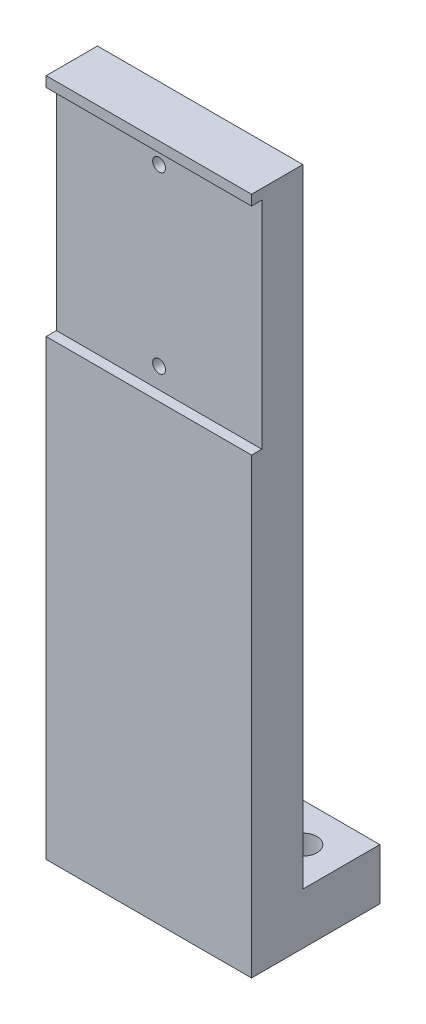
ISO-10303-21;
HEADER;
FILE_DESCRIPTION(('STEP AP214'),'2;1');
FILE_NAME('part.step','',(''),(''),'','','');
FILE_SCHEMA(('AUTOMOTIVE_DESIGN { 1 0 10303 214 1 1 1 1 }'));
ENDSEC;
DATA;
#1=APPLICATION_CONTEXT('core data for automotive mechanical design processes');
#2=APPLICATION_PROTOCOL_DEFINITION('international standard','automotive_design',2000,#1);
#3=PRODUCT_CONTEXT('',#1,'mechanical');
#4=PRODUCT('Part','Part','',(#3));
#5=PRODUCT_RELATED_PRODUCT_CATEGORY('part','',(#4));
#6=PRODUCT_DEFINITION_FORMATION('','',#4);
#7=PRODUCT_DEFINITION_CONTEXT('part definition',#1,'design');
#8=PRODUCT_DEFINITION('design','',#6,#7);
#9=PRODUCT_DEFINITION_SHAPE('','',#8);
#10=(LENGTH_UNIT() NAMED_UNIT(*) SI_UNIT(.MILLI.,.METRE.));
#11=(NAMED_UNIT(*) PLANE_ANGLE_UNIT() SI_UNIT($,.RADIAN.));
#12=(NAMED_UNIT(*) SI_UNIT($,.STERADIAN.) SOLID_ANGLE_UNIT());
#13=UNCERTAINTY_MEASURE_WITH_UNIT(LENGTH_MEASURE(1.E-05),#10,'distance_accuracy_value','');
#14=(GEOMETRIC_REPRESENTATION_CONTEXT(3) GLOBAL_UNCERTAINTY_ASSIGNED_CONTEXT((#13)) GLOBAL_UNIT_ASSIGNED_CONTEXT((#10,
#11,#12)) REPRESENTATION_CONTEXT('',''));
#15=CARTESIAN_POINT('',(0.,0.,0.));
#16=DIRECTION('',(0.,0.,1.));
#17=DIRECTION('',(1.,0.,0.));
#18=AXIS2_PLACEMENT_3D('',#15,#16,#17);
#19=CARTESIAN_POINT('',(40.,0.,25.));
#20=DIRECTION('',(0.,0.,1.));
#21=DIRECTION('',(1.,0.,0.));
#22=AXIS2_PLACEMENT_3D('',#19,#20,#21);
#23=PLANE('',#22);
#24=DIRECTION('',(0.,1.,0.));
#25=VECTOR('',#24,1.);
#26=CARTESIAN_POINT('',(40.,0.,25.));
#27=LINE('',#26,#25);
#28=CARTESIAN_POINT('',(40.,0.00372010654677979,24.9999999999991));
#29=VERTEX_POINT('',#28);
#30=CARTESIAN_POINT('',(40.,88.2037201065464,24.9999999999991));
#31=VERTEX_POINT('',#30);
#32=EDGE_CURVE('E131',#29,#31,#27,.T.);
#33=ORIENTED_EDGE('',*,*,#32,.T.);
#34=DIRECTION('',(1.,0.,0.));
#35=VECTOR('',#34,1.);
#36=CARTESIAN_POINT('',(0.,88.2037201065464,24.9999999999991));
#37=LINE('',#36,#35);
#38=CARTESIAN_POINT('',(0.,88.2037201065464,24.9999999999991));
#39=VERTEX_POINT('',#38);
#40=EDGE_CURVE('E116',#39,#31,#37,.T.);
#41=ORIENTED_EDGE('',*,*,#40,.F.);
#42=DIRECTION('',(0.,-1.,0.));
#43=VECTOR('',#42,1.);
#44=CARTESIAN_POINT('',(0.,0.,25.));
#45=LINE('',#44,#43);
#46=CARTESIAN_POINT('',(0.,0.00372010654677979,25.));
#47=VERTEX_POINT('',#46);
#48=EDGE_CURVE('E129',#39,#47,#45,.T.);
#49=ORIENTED_EDGE('',*,*,#48,.T.);
#50=DIRECTION('',(1.,0.,0.));
#51=VECTOR('',#50,1.);
#52=CARTESIAN_POINT('',(0.,0.00372010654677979,24.9999999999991));
#53=LINE('',#52,#51);
#54=EDGE_CURVE('E50',#47,#29,#53,.T.);
#55=ORIENTED_EDGE('',*,*,#54,.T.);
#56=EDGE_LOOP('',(#33,#41,#49,#55));
#57=FACE_BOUND('',#56,.T.);
#58=ADVANCED_FACE('F33',(#57),#23,.T.);
#59=CARTESIAN_POINT('',(0.,132.2,25.));
#60=VERTEX_POINT('',#59);
#61=CARTESIAN_POINT('',(0.,130.203720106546,25.));
#62=VERTEX_POINT('',#61);
#63=EDGE_CURVE('E136',#60,#62,#45,.T.);
#64=ORIENTED_EDGE('',*,*,#63,.T.);
#65=DIRECTION('',(1.,0.,0.));
#66=VECTOR('',#65,1.);
#67=CARTESIAN_POINT('',(0.,130.203720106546,24.9999999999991));
#68=LINE('',#67,#66);
#69=CARTESIAN_POINT('',(40.,130.203720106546,24.9999999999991));
#70=VERTEX_POINT('',#69);
#71=EDGE_CURVE('E58',#62,#70,#68,.T.);
#72=ORIENTED_EDGE('',*,*,#71,.T.);
#73=CARTESIAN_POINT('',(40.,132.2,25.));
#74=VERTEX_POINT('',#73);
#75=EDGE_CURVE('E149',#70,#74,#27,.T.);
#76=ORIENTED_EDGE('',*,*,#75,.T.);
#77=DIRECTION('',(-1.,0.,0.));
#78=VECTOR('',#77,1.);
#79=CARTESIAN_POINT('',(0.,132.2,25.));
#80=LINE('',#79,#78);
#81=EDGE_CURVE('E137',#74,#60,#80,.T.);
#82=ORIENTED_EDGE('',*,*,#81,.T.);
#83=EDGE_LOOP('',(#64,#72,#76,#82));
#84=FACE_BOUND('',#83,.T.);
#85=ADVANCED_FACE('F216',(#84),#23,.T.);
#86=CARTESIAN_POINT('',(40.,0.,0.));
#87=DIRECTION('',(0.,0.,1.));
#88=DIRECTION('',(1.,0.,0.));
#89=AXIS2_PLACEMENT_3D('',#86,#87,#88);
#90=PLANE('',#89);
#91=DIRECTION('',(1.,0.,0.));
#92=VECTOR('',#91,1.);
#93=CARTESIAN_POINT('',(0.,10.0037201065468,-9.09494701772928E-13));
#94=LINE('',#93,#92);
#95=CARTESIAN_POINT('',(0.,10.0037201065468,0.));
#96=VERTEX_POINT('',#95);
#97=CARTESIAN_POINT('',(40.,10.0037201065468,-9.09494701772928E-13));
#98=VERTEX_POINT('',#97);
#99=EDGE_CURVE('E203',#96,#98,#94,.T.);
#100=ORIENTED_EDGE('',*,*,#99,.T.);
#101=DIRECTION('',(0.,1.,0.));
#102=VECTOR('',#101,1.);
#103=CARTESIAN_POINT('',(40.,0.,0.));
#104=LINE('',#103,#102);
#105=CARTESIAN_POINT('',(40.,0.00372010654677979,-9.09494701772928E-13));
#106=VERTEX_POINT('',#105);
#107=EDGE_CURVE('E143',#106,#98,#104,.T.);
#108=ORIENTED_EDGE('',*,*,#107,.F.);
#109=DIRECTION('',(1.,0.,0.));
#110=VECTOR('',#109,1.);
#111=CARTESIAN_POINT('',(0.,0.00372010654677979,-9.09494701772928E-13));
#112=LINE('',#111,#110);
#113=CARTESIAN_POINT('',(0.,0.00372010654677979,-9.09494701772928E-13));
#114=VERTEX_POINT('',#113);
#115=EDGE_CURVE('E206',#114,#106,#112,.T.);
#116=ORIENTED_EDGE('',*,*,#115,.F.);
#117=DIRECTION('',(0.,-1.,0.));
#118=VECTOR('',#117,1.);
#119=CARTESIAN_POINT('',(0.,0.,0.));
#120=LINE('',#119,#118);
#121=EDGE_CURVE('E146',#96,#114,#120,.T.);
#122=ORIENTED_EDGE('',*,*,#121,.F.);
#123=EDGE_LOOP('',(#100,#108,#116,#122));
#124=FACE_BOUND('',#123,.T.);
#125=ADVANCED_FACE('F233',(#124),#90,.F.);
#126=CARTESIAN_POINT('',(40.,0.,25.));
#127=DIRECTION('',(-1.,0.,0.));
#128=DIRECTION('',(0.,0.,1.));
#129=AXIS2_PLACEMENT_3D('',#126,#127,#128);
#130=PLANE('',#129);
#131=DIRECTION('',(0.,0.,1.));
#132=VECTOR('',#131,1.);
#133=CARTESIAN_POINT('',(40.,88.2037201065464,24.9999999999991));
#134=LINE('',#133,#132);
#135=CARTESIAN_POINT('',(40.,88.2037201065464,22.9999999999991));
#136=VERTEX_POINT('',#135);
#137=EDGE_CURVE('E161',#136,#31,#134,.T.);
#138=ORIENTED_EDGE('',*,*,#137,.T.);
#139=ORIENTED_EDGE('',*,*,#32,.F.);
#140=DIRECTION('',(0.,0.,-1.));
#141=VECTOR('',#140,1.);
#142=CARTESIAN_POINT('',(40.,0.00372010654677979,24.9999999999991));
#143=LINE('',#142,#141);
#144=EDGE_CURVE('E165',#29,#106,#143,.T.);
#145=ORIENTED_EDGE('',*,*,#144,.T.);
#146=ORIENTED_EDGE('',*,*,#107,.T.);
#147=DIRECTION('',(0.,0.,1.));
#148=VECTOR('',#147,1.);
#149=CARTESIAN_POINT('',(40.,10.0037201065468,14.9999999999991));
#150=LINE('',#149,#148);
#151=CARTESIAN_POINT('',(40.,10.0037201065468,14.9999999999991));
#152=VERTEX_POINT('',#151);
#153=EDGE_CURVE('E186',#98,#152,#150,.T.);
#154=ORIENTED_EDGE('',*,*,#153,.T.);
#155=DIRECTION('',(0.,1.,0.));
#156=VECTOR('',#155,1.);
#157=CARTESIAN_POINT('',(40.,10.0037201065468,14.9999999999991));
#158=LINE('',#157,#156);
#159=CARTESIAN_POINT('',(40.,132.2,14.9999999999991));
#160=VERTEX_POINT('',#159);
#161=EDGE_CURVE('E189',#152,#160,#158,.T.);
#162=ORIENTED_EDGE('',*,*,#161,.T.);
#163=DIRECTION('',(0.,0.,-1.));
#164=VECTOR('',#163,1.);
#165=CARTESIAN_POINT('',(40.,132.2,25.));
#166=LINE('',#165,#164);
#167=EDGE_CURVE('E12',#74,#160,#166,.T.);
#168=ORIENTED_EDGE('',*,*,#167,.F.);
#169=ORIENTED_EDGE('',*,*,#75,.F.);
#170=DIRECTION('',(0.,0.,-1.));
#171=VECTOR('',#170,1.);
#172=CARTESIAN_POINT('',(40.,130.203720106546,24.9999999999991));
#173=LINE('',#172,#171);
#174=CARTESIAN_POINT('',(40.,130.203720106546,22.9999999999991));
#175=VERTEX_POINT('',#174);
#176=EDGE_CURVE('E192',#70,#175,#173,.T.);
#177=ORIENTED_EDGE('',*,*,#176,.T.);
#178=DIRECTION('',(0.,-1.,0.));
#179=VECTOR('',#178,1.);
#180=CARTESIAN_POINT('',(40.,88.2037201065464,22.9999999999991));
#181=LINE('',#180,#179);
#182=EDGE_CURVE('E124',#175,#136,#181,.T.);
#183=ORIENTED_EDGE('',*,*,#182,.T.);
#184=EDGE_LOOP('',(#138,#139,#145,#146,#154,#162,#168,#169,#177,#183));
#185=FACE_BOUND('',#184,.T.);
#186=ADVANCED_FACE('F35',(#185),#130,.F.);
#187=CARTESIAN_POINT('',(0.,132.2,25.));
#188=DIRECTION('',(0.,-1.,0.));
#189=DIRECTION('',(0.,0.,-1.));
#190=AXIS2_PLACEMENT_3D('',#187,#188,#189);
#191=PLANE('',#190);
#192=DIRECTION('',(1.,0.,0.));
#193=VECTOR('',#192,1.);
#194=CARTESIAN_POINT('',(0.,132.2,14.9999999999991));
#195=LINE('',#194,#193);
#196=CARTESIAN_POINT('',(0.,132.2,14.9999999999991));
#197=VERTEX_POINT('',#196);
#198=EDGE_CURVE('E158',#197,#160,#195,.T.);
#199=ORIENTED_EDGE('',*,*,#198,.F.);
#200=DIRECTION('',(0.,0.,-1.));
#201=VECTOR('',#200,1.);
#202=CARTESIAN_POINT('',(0.,132.2,25.));
#203=LINE('',#202,#201);
#204=EDGE_CURVE('E42',#60,#197,#203,.T.);
#205=ORIENTED_EDGE('',*,*,#204,.F.);
#206=ORIENTED_EDGE('',*,*,#81,.F.);
#207=ORIENTED_EDGE('',*,*,#167,.T.);
#208=EDGE_LOOP('',(#199,#205,#206,#207));
#209=FACE_BOUND('',#208,.T.);
#210=ADVANCED_FACE('F223',(#209),#191,.F.);
#211=CARTESIAN_POINT('',(0.,0.,25.));
#212=DIRECTION('',(1.,0.,0.));
#213=DIRECTION('',(0.,0.,-1.));
#214=AXIS2_PLACEMENT_3D('',#211,#212,#213);
#215=PLANE('',#214);
#216=DIRECTION('',(0.,0.,1.));
#217=VECTOR('',#216,1.);
#218=CARTESIAN_POINT('',(0.,88.2037201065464,24.9999999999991));
#219=LINE('',#218,#217);
#220=CARTESIAN_POINT('',(0.,88.2037201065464,22.9999999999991));
#221=VERTEX_POINT('',#220);
#222=EDGE_CURVE('E112',#221,#39,#219,.T.);
#223=ORIENTED_EDGE('',*,*,#222,.F.);
#224=DIRECTION('',(0.,-1.,0.));
#225=VECTOR('',#224,1.);
#226=CARTESIAN_POINT('',(0.,88.2037201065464,22.9999999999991));
#227=LINE('',#226,#225);
#228=CARTESIAN_POINT('',(0.,130.203720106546,22.9999999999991));
#229=VERTEX_POINT('',#228);
#230=EDGE_CURVE('E132',#229,#221,#227,.T.);
#231=ORIENTED_EDGE('',*,*,#230,.F.);
#232=DIRECTION('',(0.,0.,-1.));
#233=VECTOR('',#232,1.);
#234=CARTESIAN_POINT('',(0.,130.203720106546,24.9999999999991));
#235=LINE('',#234,#233);
#236=EDGE_CURVE('E181',#62,#229,#235,.T.);
#237=ORIENTED_EDGE('',*,*,#236,.F.);
#238=ORIENTED_EDGE('',*,*,#63,.F.);
#239=ORIENTED_EDGE('',*,*,#204,.T.);
#240=DIRECTION('',(0.,1.,0.));
#241=VECTOR('',#240,1.);
#242=CARTESIAN_POINT('',(0.,10.0037201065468,14.9999999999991));
#243=LINE('',#242,#241);
#244=CARTESIAN_POINT('',(0.,10.0037201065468,14.9999999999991));
#245=VERTEX_POINT('',#244);
#246=EDGE_CURVE('E179',#245,#197,#243,.T.);
#247=ORIENTED_EDGE('',*,*,#246,.F.);
#248=DIRECTION('',(0.,0.,1.));
#249=VECTOR('',#248,1.);
#250=CARTESIAN_POINT('',(0.,10.0037201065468,14.9999999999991));
#251=LINE('',#250,#249);
#252=EDGE_CURVE('E176',#96,#245,#251,.T.);
#253=ORIENTED_EDGE('',*,*,#252,.F.);
#254=ORIENTED_EDGE('',*,*,#121,.T.);
#255=DIRECTION('',(0.,0.,-1.));
#256=VECTOR('',#255,1.);
#257=CARTESIAN_POINT('',(0.,0.00372010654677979,24.9999999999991));
#258=LINE('',#257,#256);
#259=EDGE_CURVE('E123',#47,#114,#258,.T.);
#260=ORIENTED_EDGE('',*,*,#259,.F.);
#261=ORIENTED_EDGE('',*,*,#48,.F.);
#262=EDGE_LOOP('',(#223,#231,#237,#238,#239,#247,#253,#254,#260,#261));
#263=FACE_BOUND('',#262,.T.);
#264=ADVANCED_FACE('F134',(#263),#215,.F.);
#265=CARTESIAN_POINT('',(0.,10.0037201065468,14.9999999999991));
#266=DIRECTION('',(0.,0.,-1.));
#267=DIRECTION('',(-1.,0.,0.));
#268=AXIS2_PLACEMENT_3D('',#265,#266,#267);
#269=PLANE('',#268);
#270=CARTESIAN_POINT('',(20.,126.2,14.9999999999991));
#271=DIRECTION('',(0.,0.,-1.));
#272=DIRECTION('',(-1.,0.,0.));
#273=AXIS2_PLACEMENT_3D('',#270,#271,#272);
#274=CIRCLE('',#273,1.25);
#275=CARTESIAN_POINT('',(18.75,126.2,14.9999999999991));
#276=VERTEX_POINT('',#275);
#277=EDGE_CURVE('E152',#276,#276,#274,.T.);
#278=ORIENTED_EDGE('',*,*,#277,.F.);
#279=EDGE_LOOP('',(#278));
#280=FACE_BOUND('',#279,.T.);
#281=CARTESIAN_POINT('',(20.,92.1999999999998,14.9999999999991));
#282=DIRECTION('',(0.,0.,-1.));
#283=DIRECTION('',(-1.,0.,0.));
#284=AXIS2_PLACEMENT_3D('',#281,#282,#283);
#285=CIRCLE('',#284,1.25);
#286=CARTESIAN_POINT('',(18.75,92.1999999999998,14.9999999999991));
#287=VERTEX_POINT('',#286);
#288=EDGE_CURVE('E155',#287,#287,#285,.T.);
#289=ORIENTED_EDGE('',*,*,#288,.F.);
#290=EDGE_LOOP('',(#289));
#291=FACE_BOUND('',#290,.T.);
#292=ORIENTED_EDGE('',*,*,#198,.T.);
#293=ORIENTED_EDGE('',*,*,#161,.F.);
#294=DIRECTION('',(1.,0.,0.));
#295=VECTOR('',#294,1.);
#296=CARTESIAN_POINT('',(0.,10.0037201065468,14.9999999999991));
#297=LINE('',#296,#295);
#298=EDGE_CURVE('E201',#245,#152,#297,.T.);
#299=ORIENTED_EDGE('',*,*,#298,.F.);
#300=ORIENTED_EDGE('',*,*,#246,.T.);
#301=EDGE_LOOP('',(#292,#293,#299,#300));
#302=FACE_BOUND('',#301,.T.);
#303=ADVANCED_FACE('F239',(#280,#291,#302),#269,.T.);
#304=CARTESIAN_POINT('',(0.,10.0037201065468,14.9999999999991));
#305=DIRECTION('',(0.,1.,0.));
#306=DIRECTION('',(0.,0.,1.));
#307=AXIS2_PLACEMENT_3D('',#304,#305,#306);
#308=PLANE('',#307);
#309=CARTESIAN_POINT('',(32.5,10.0037201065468,7.5));
#310=DIRECTION('',(0.,1.,0.));
#311=DIRECTION('',(0.,0.,1.));
#312=AXIS2_PLACEMENT_3D('',#309,#310,#311);
#313=CIRCLE('',#312,2.75);
#314=CARTESIAN_POINT('',(32.5,10.0037201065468,10.25));
#315=VERTEX_POINT('',#314);
#316=EDGE_CURVE('E172',#315,#315,#313,.T.);
#317=ORIENTED_EDGE('',*,*,#316,.F.);
#318=EDGE_LOOP('',(#317));
#319=FACE_BOUND('',#318,.T.);
#320=CARTESIAN_POINT('',(7.5,10.0037201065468,7.5));
#321=DIRECTION('',(0.,1.,0.));
#322=DIRECTION('',(0.,0.,1.));
#323=AXIS2_PLACEMENT_3D('',#320,#321,#322);
#324=CIRCLE('',#323,2.75);
#325=CARTESIAN_POINT('',(7.5,10.0037201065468,10.25));
#326=VERTEX_POINT('',#325);
#327=EDGE_CURVE('E162',#326,#326,#324,.T.);
#328=ORIENTED_EDGE('',*,*,#327,.F.);
#329=EDGE_LOOP('',(#328));
#330=FACE_BOUND('',#329,.T.);
#331=ORIENTED_EDGE('',*,*,#153,.F.);
#332=ORIENTED_EDGE('',*,*,#99,.F.);
#333=ORIENTED_EDGE('',*,*,#252,.T.);
#334=ORIENTED_EDGE('',*,*,#298,.T.);
#335=EDGE_LOOP('',(#331,#332,#333,#334));
#336=FACE_BOUND('',#335,.T.);
#337=ADVANCED_FACE('F237',(#319,#330,#336),#308,.T.);
#338=CARTESIAN_POINT('',(0.,88.2037201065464,22.9999999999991));
#339=DIRECTION('',(0.,0.,1.));
#340=DIRECTION('',(1.,0.,0.));
#341=AXIS2_PLACEMENT_3D('',#338,#339,#340);
#342=PLANE('',#341);
#343=CARTESIAN_POINT('',(20.,92.1999999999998,22.9999999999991));
#344=DIRECTION('',(0.,0.,1.));
#345=DIRECTION('',(1.,0.,0.));
#346=AXIS2_PLACEMENT_3D('',#343,#344,#345);
#347=CIRCLE('',#346,1.25);
#348=CARTESIAN_POINT('',(21.25,92.1999999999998,22.9999999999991));
#349=VERTEX_POINT('',#348);
#350=EDGE_CURVE('E147',#349,#349,#347,.T.);
#351=ORIENTED_EDGE('',*,*,#350,.F.);
#352=EDGE_LOOP('',(#351));
#353=FACE_BOUND('',#352,.T.);
#354=CARTESIAN_POINT('',(20.,126.2,22.9999999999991));
#355=DIRECTION('',(0.,0.,1.));
#356=DIRECTION('',(1.,0.,0.));
#357=AXIS2_PLACEMENT_3D('',#354,#355,#356);
#358=CIRCLE('',#357,1.25);
#359=CARTESIAN_POINT('',(21.25,126.2,22.9999999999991));
#360=VERTEX_POINT('',#359);
#361=EDGE_CURVE('E156',#360,#360,#358,.T.);
#362=ORIENTED_EDGE('',*,*,#361,.F.);
#363=EDGE_LOOP('',(#362));
#364=FACE_BOUND('',#363,.T.);
#365=ORIENTED_EDGE('',*,*,#182,.F.);
#366=DIRECTION('',(1.,0.,0.));
#367=VECTOR('',#366,1.);
#368=CARTESIAN_POINT('',(0.,130.203720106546,22.9999999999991));
#369=LINE('',#368,#367);
#370=EDGE_CURVE('E198',#229,#175,#369,.T.);
#371=ORIENTED_EDGE('',*,*,#370,.F.);
#372=ORIENTED_EDGE('',*,*,#230,.T.);
#373=DIRECTION('',(1.,0.,0.));
#374=VECTOR('',#373,1.);
#375=CARTESIAN_POINT('',(0.,88.2037201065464,22.9999999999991));
#376=LINE('',#375,#374);
#377=EDGE_CURVE('E118',#221,#136,#376,.T.);
#378=ORIENTED_EDGE('',*,*,#377,.T.);
#379=EDGE_LOOP('',(#365,#371,#372,#378));
#380=FACE_BOUND('',#379,.T.);
#381=ADVANCED_FACE('F229',(#353,#364,#380),#342,.T.);
#382=CARTESIAN_POINT('',(0.,130.203720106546,24.9999999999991));
#383=DIRECTION('',(0.,-1.,0.));
#384=DIRECTION('',(0.,0.,-1.));
#385=AXIS2_PLACEMENT_3D('',#382,#383,#384);
#386=PLANE('',#385);
#387=ORIENTED_EDGE('',*,*,#176,.F.);
#388=ORIENTED_EDGE('',*,*,#71,.F.);
#389=ORIENTED_EDGE('',*,*,#236,.T.);
#390=ORIENTED_EDGE('',*,*,#370,.T.);
#391=EDGE_LOOP('',(#387,#388,#389,#390));
#392=FACE_BOUND('',#391,.T.);
#393=ADVANCED_FACE('F226',(#392),#386,.T.);
#394=CARTESIAN_POINT('',(0.,88.2037201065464,24.9999999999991));
#395=DIRECTION('',(0.,1.,0.));
#396=DIRECTION('',(0.,0.,1.));
#397=AXIS2_PLACEMENT_3D('',#394,#395,#396);
#398=PLANE('',#397);
#399=ORIENTED_EDGE('',*,*,#137,.F.);
#400=ORIENTED_EDGE('',*,*,#377,.F.);
#401=ORIENTED_EDGE('',*,*,#222,.T.);
#402=ORIENTED_EDGE('',*,*,#40,.T.);
#403=EDGE_LOOP('',(#399,#400,#401,#402));
#404=FACE_BOUND('',#403,.T.);
#405=ADVANCED_FACE('F115',(#404),#398,.T.);
#406=CARTESIAN_POINT('',(20.,92.1999999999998,25.));
#407=DIRECTION('',(0.,0.,-1.));
#408=DIRECTION('',(-1.,0.,0.));
#409=AXIS2_PLACEMENT_3D('',#406,#407,#408);
#410=CYLINDRICAL_SURFACE('',#409,1.25);
#411=ORIENTED_EDGE('',*,*,#288,.T.);
#412=EDGE_LOOP('',(#411));
#413=FACE_BOUND('',#412,.T.);
#414=ORIENTED_EDGE('',*,*,#350,.T.);
#415=EDGE_LOOP('',(#414));
#416=FACE_BOUND('',#415,.T.);
#417=ADVANCED_FACE('F260',(#413,#416),#410,.F.);
#418=CARTESIAN_POINT('',(0.,0.00372010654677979,24.9999999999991));
#419=DIRECTION('',(0.,-1.,0.));
#420=DIRECTION('',(0.,0.,-1.));
#421=AXIS2_PLACEMENT_3D('',#418,#419,#420);
#422=PLANE('',#421);
#423=CARTESIAN_POINT('',(32.5,0.00372010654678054,7.5));
#424=DIRECTION('',(0.,-1.,0.));
#425=DIRECTION('',(0.,0.,-1.));
#426=AXIS2_PLACEMENT_3D('',#423,#424,#425);
#427=CIRCLE('',#426,2.75);
#428=CARTESIAN_POINT('',(32.5,0.00372010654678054,4.75));
#429=VERTEX_POINT('',#428);
#430=EDGE_CURVE('E37',#429,#429,#427,.T.);
#431=ORIENTED_EDGE('',*,*,#430,.F.);
#432=EDGE_LOOP('',(#431));
#433=FACE_BOUND('',#432,.T.);
#434=CARTESIAN_POINT('',(7.5,0.00372010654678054,7.5));
#435=DIRECTION('',(0.,-1.,0.));
#436=DIRECTION('',(0.,0.,-1.));
#437=AXIS2_PLACEMENT_3D('',#434,#435,#436);
#438=CIRCLE('',#437,2.75);
#439=CARTESIAN_POINT('',(7.5,0.00372010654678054,4.75));
#440=VERTEX_POINT('',#439);
#441=EDGE_CURVE('E159',#440,#440,#438,.T.);
#442=ORIENTED_EDGE('',*,*,#441,.F.);
#443=EDGE_LOOP('',(#442));
#444=FACE_BOUND('',#443,.T.);
#445=ORIENTED_EDGE('',*,*,#144,.F.);
#446=ORIENTED_EDGE('',*,*,#54,.F.);
#447=ORIENTED_EDGE('',*,*,#259,.T.);
#448=ORIENTED_EDGE('',*,*,#115,.T.);
#449=EDGE_LOOP('',(#445,#446,#447,#448));
#450=FACE_BOUND('',#449,.T.);
#451=ADVANCED_FACE('F320',(#433,#444,#450),#422,.T.);
#452=CARTESIAN_POINT('',(20.,126.2,25.));
#453=DIRECTION('',(0.,0.,-1.));
#454=DIRECTION('',(-1.,0.,0.));
#455=AXIS2_PLACEMENT_3D('',#452,#453,#454);
#456=CYLINDRICAL_SURFACE('',#455,1.25);
#457=ORIENTED_EDGE('',*,*,#277,.T.);
#458=EDGE_LOOP('',(#457));
#459=FACE_BOUND('',#458,.T.);
#460=ORIENTED_EDGE('',*,*,#361,.T.);
#461=EDGE_LOOP('',(#460));
#462=FACE_BOUND('',#461,.T.);
#463=ADVANCED_FACE('F325',(#459,#462),#456,.F.);
#464=CARTESIAN_POINT('',(7.5,-14.9962798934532,7.5));
#465=DIRECTION('',(0.,1.,0.));
#466=DIRECTION('',(0.,0.,1.));
#467=AXIS2_PLACEMENT_3D('',#464,#465,#466);
#468=CYLINDRICAL_SURFACE('',#467,2.75);
#469=ORIENTED_EDGE('',*,*,#441,.T.);
#470=EDGE_LOOP('',(#469));
#471=FACE_BOUND('',#470,.T.);
#472=ORIENTED_EDGE('',*,*,#327,.T.);
#473=EDGE_LOOP('',(#472));
#474=FACE_BOUND('',#473,.T.);
#475=ADVANCED_FACE('F330',(#471,#474),#468,.F.);
#476=CARTESIAN_POINT('',(32.5,-14.9962798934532,7.5));
#477=DIRECTION('',(0.,1.,0.));
#478=DIRECTION('',(0.,0.,1.));
#479=AXIS2_PLACEMENT_3D('',#476,#477,#478);
#480=CYLINDRICAL_SURFACE('',#479,2.75);
#481=ORIENTED_EDGE('',*,*,#430,.T.);
#482=EDGE_LOOP('',(#481));
#483=FACE_BOUND('',#482,.T.);
#484=ORIENTED_EDGE('',*,*,#316,.T.);
#485=EDGE_LOOP('',(#484));
#486=FACE_BOUND('',#485,.T.);
#487=ADVANCED_FACE('F335',(#483,#486),#480,.F.);
#488=CLOSED_SHELL('',(#58,#85,#125,#186,#210,#264,#303,#337,#381,#393,#405,#417,#451,#463,#475,#487));
#489=MANIFOLD_SOLID_BREP('B2',#488);
#490=ADVANCED_BREP_SHAPE_REPRESENTATION('',(#18,#489),#14);
#491=SHAPE_DEFINITION_REPRESENTATION(#9,#490);
ENDSEC;
END-ISO-10303-21;
